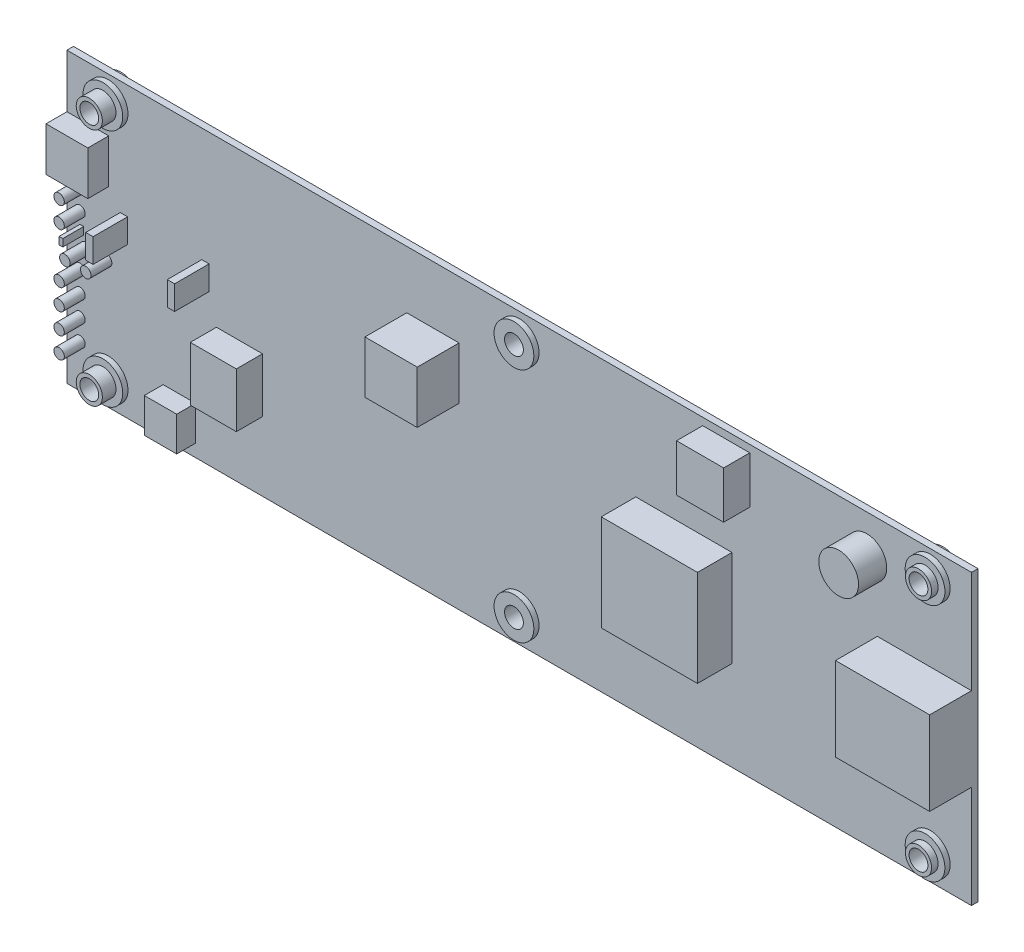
from build123d import *

# Parameters (mm, degrees)
SKETCH1_W           = 219.71
SKETCH1_H           = 70.104
PC_BOARD_DEPTH      = 1.5875
SKETCH2_R           = 2.286
THRU_HOLES_DEPTH    = 231.628651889
SKETCH4_W           = 12.7
SKETCH4_H           = 12.7
TRANSFORMER_DEPTH   = 10.16
SKETCH5_W           = 22.86
SKETCH5_H           = 20.32
CONNECTOR_DEPTH     = 10.16
SKETCH6_W           = 23.368
SKETCH6_H           = 23.368
CPU_DEPTH           = 8.382
SKETCH7_W           = 11.43
SKETCH7_H           = 11.43
INDUCTOR_DEPTH      = 6.35
SKETCH8_W           = 7.874
SKETCH8_H           = 8.382
VISHAY_DEPTH        = 4.572
SKETCH9_W           = 1.778
SKETCH9_H           = 5.842
CAPS_DEPTH          = 8.382
SKETCH10_W          = 11.176
SKETCH10_H          = 13.208
CRYSTAL_DEPTH       = 6.35
SKETCH11_R          = 4.826
EXTRUDE9_DEPTH      = 6.858
SKETCH13_R          = 1.27
SKETCH13_W          = 0.911656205
SKETCH13_H          = 1.789200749
SOLDER_PINS_DEPTH   = 5.08
SKETCH14_W          = 10.16
SKETCH14_H          = 10.668
VISHAY2_DEPTH       = 5.08
GROMMETS_START      = 1.27
SKETCH15_R          = 4.826
SKETCH15_R_2        = 2.286
GROMMETS_DEPTH      = 1.27
REAR_SPACERS_START  = 3.302
SKETCH16_R          = 3.175
SKETCH16_R_2        = 2.286
REAR_SPACERS_DEPTH  = 3.302
FRONT_SPACERS_START = 1.5875
SKETCH18_R          = 3.175
SKETCH18_R_2        = 2.286
FRONT_SPACERS_DEPTH = 1.5875
SKETCH19_R          = 4.826
SKETCH19_R_2        = 2.286
BACK_GROMMETS_DEPTH = 1.524


with BuildPart() as part:
    # Sketch1 → pc_board (new body)
    with BuildSketch(Plane.XY):
        with Locations((109.855, 35.052)):
            Rectangle(SKETCH1_W, SKETCH1_H)
    extrude(amount=PC_BOARD_DEPTH)

    # Sketch2 → thru_holes (cut, through all)
    with BuildSketch(Plane.XY.offset(1.5875)):
        with Locations((209.7024, 64.1096)):
            Circle(SKETCH2_R)
        with Locations(Location((10.0076, 64.1096, 0), (0, 0, 180))):
            Circle(SKETCH2_R)
        with Locations((109.855, 63.754)):
            Circle(SKETCH2_R)
        with Locations(Location((209.7024, 5.9944, 0), (0, 0, 180))):
            Circle(SKETCH2_R)
        with Locations(Location((109.855, 6.35, 0), (0, 0, 180))):
            Circle(SKETCH2_R)
        with Locations((10.0076, 5.9944)):
            Circle(SKETCH2_R)
    extrude(amount=-THRU_HOLES_DEPTH, mode=Mode.SUBTRACT)

    # Sketch4 → transformer (add)
    with BuildSketch(Plane.XY.offset(1.5875)):
        with Locations((88.9, 49.784)):
            Rectangle(SKETCH4_W, SKETCH4_H)
    extrude(amount=TRANSFORMER_DEPTH)

    # Sketch5 → connector (add)
    with BuildSketch(Plane.XY.offset(1.5875)):
        with Locations((208.28, 35.052)):
            Rectangle(SKETCH5_W, SKETCH5_H)
    extrude(amount=CONNECTOR_DEPTH)

    # Sketch6 → cpu (add)
    with BuildSketch(Plane.XY.offset(1.5875)):
        with Locations((149.86, 33.528)):
            Rectangle(SKETCH6_W, SKETCH6_H)
    extrude(amount=CPU_DEPTH)

    # Sketch7 → inductor (add)
    with BuildSketch(Plane.XY.offset(1.5875)):
        with Locations((160.147, 62.611)):
            Rectangle(SKETCH7_W, SKETCH7_H)
    extrude(amount=INDUCTOR_DEPTH)

    # Sketch8 → Vishay (add)
    with BuildSketch(Plane.XY.offset(1.5875)):
        with Locations((27.305, 7.239)):
            Rectangle(SKETCH8_W, SKETCH8_H)
    extrude(amount=VISHAY_DEPTH)

    # Sketch9 → caps (add)
    with BuildSketch(Plane.XY.offset(1.5875)):
        with Locations((13.843, 39.497)):
            Rectangle(SKETCH9_W, SKETCH9_H)
        with Locations((33.655, 39.497)):
            Rectangle(SKETCH9_W, SKETCH9_H)
    extrude(amount=CAPS_DEPTH)

    # Sketch10 → crystal (add)
    with BuildSketch(Plane.XY.offset(1.5875)):
        with Locations((41.91, 23.368)):
            Rectangle(SKETCH10_W, SKETCH10_H)
    extrude(amount=CRYSTAL_DEPTH)

    # Sketch11 → Extrude9 (add)
    with BuildSketch(Plane.XY.offset(1.5875)):
        with Locations(Location((194.31, 60.706, 0), (0, 0, 180))):
            Circle(SKETCH11_R)
    extrude(amount=EXTRUDE9_DEPTH)

    # Sketch13 → solder_pins (add)
    with BuildSketch(Plane.XY.offset(1.5875)):
        with Locations(Location((3.175, 42.926, 0), (0, 0, 180))):
            Circle(SKETCH13_R)
        with Locations(Location((3.175, 37.846, 0), (0, 0, 180))):
            Circle(SKETCH13_R)
        with Locations(Location((3.175, 25.654, 0), (0, 0, 180))):
            Circle(SKETCH13_R)
        with Locations(Location((3.175, 20.574, 0), (0, 0, 180))):
            Circle(SKETCH13_R)
        with Locations(Location((3.175, 15.494, 0), (0, 0, 180))):
            Circle(SKETCH13_R)
        with Locations(Location((3.175, 10.414, 0), (0, 0, 180))):
            Circle(SKETCH13_R)
        with Locations(Location((4.572, 30.734, 0), (0, 0, 180))):
            Circle(SKETCH13_R)
        with Locations(Location((9.652, 30.734, 0), (0, 0, 180))):
            Circle(SKETCH13_R)
        with Locations((3.630828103, 34.157399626)):
            Rectangle(SKETCH13_W, SKETCH13_H)
    extrude(amount=SOLDER_PINS_DEPTH)

    # Sketch14 → vishay2 (add)
    with BuildSketch(Plane.XY.offset(1.5875)):
        with Locations((5.08, 51.816)):
            Rectangle(SKETCH14_W, SKETCH14_H)
    extrude(amount=VISHAY2_DEPTH)

    # Sketch15 → grommets (add)
    # profile 1 of 6: a face of its own
    with BuildSketch(Plane.XY.offset(1.5875).offset(GROMMETS_START)):
        with Locations(Location((209.7024, 64.1096, 0), (0, 0, 180))):
            Circle(SKETCH15_R)
        with Locations((209.7024, 64.1096)):
            Circle(SKETCH15_R_2, mode=Mode.SUBTRACT)
    # profile 2 of 6: a face of its own
    with BuildSketch(Plane.XY.offset(1.5875).offset(GROMMETS_START)):
        with Locations(Location((10.0076, 64.1096, 0), (0, 0, 180))):
            Circle(SKETCH15_R)
        with Locations(Location((10.0076, 64.1096, 0), (0, 0, 180))):
            Circle(SKETCH15_R_2, mode=Mode.SUBTRACT)
    # profile 3 of 6: a face of its own
    with BuildSketch(Plane.XY.offset(1.5875).offset(GROMMETS_START)):
        with Locations(Location((109.855, 63.754, 0), (0, 0, 180))):
            Circle(SKETCH15_R)
        with Locations((109.855, 63.754)):
            Circle(SKETCH15_R_2, mode=Mode.SUBTRACT)
    # profile 4 of 6: a face of its own
    with BuildSketch(Plane.XY.offset(1.5875).offset(GROMMETS_START)):
        with Locations(Location((109.855, 6.35, 0), (0, 0, 180))):
            Circle(SKETCH15_R)
        with Locations(Location((109.855, 6.35, 0), (0, 0, 180))):
            Circle(SKETCH15_R_2, mode=Mode.SUBTRACT)
    # profile 5 of 6: a face of its own
    with BuildSketch(Plane.XY.offset(1.5875).offset(GROMMETS_START)):
        with Locations(Location((10.0076, 5.9944, 0), (0, 0, 180))):
            Circle(SKETCH15_R)
        with Locations((10.0076, 5.9944)):
            Circle(SKETCH15_R_2, mode=Mode.SUBTRACT)
    # profile 6 of 6: a face of its own
    with BuildSketch(Plane.XY.offset(1.5875).offset(GROMMETS_START)):
        with Locations(Location((209.7024, 5.9944, 0), (0, 0, 180))):
            Circle(SKETCH15_R)
        with Locations(Location((209.7024, 5.9944, 0), (0, 0, 180))):
            Circle(SKETCH15_R_2, mode=Mode.SUBTRACT)
    extrude(amount=-GROMMETS_DEPTH)

    # Sketch16 → rear_spacers (add)
    # profile 1 of 2: a face of its own
    with BuildSketch(Plane.XY.offset(2.8575).offset(REAR_SPACERS_START)):
        with Locations(Location((10.0076, 64.1096, 0), (0, 0, 180))):
            Circle(SKETCH16_R)
        with Locations((10.0076, 64.1096)):
            Circle(SKETCH16_R_2, mode=Mode.SUBTRACT)
    # profile 2 of 2: a face of its own
    with BuildSketch(Plane.XY.offset(2.8575).offset(REAR_SPACERS_START)):
        with Locations(Location((10.0076, 5.9944, 0), (0, 0, 180))):
            Circle(SKETCH16_R)
        with Locations((10.0076, 5.9944)):
            Circle(SKETCH16_R_2, mode=Mode.SUBTRACT)
    extrude(amount=-REAR_SPACERS_DEPTH)

    # Sketch18 → front_spacers (add)
    # profile 1 of 2: a face of its own
    with BuildSketch(Plane.XY.offset(2.8575).offset(FRONT_SPACERS_START)):
        with Locations(Location((209.7024, 5.9944, 0), (0, 0, 180))):
            Circle(SKETCH18_R)
        with Locations((209.7024, 5.9944)):
            Circle(SKETCH18_R_2, mode=Mode.SUBTRACT)
    # profile 2 of 2: a face of its own
    with BuildSketch(Plane.XY.offset(2.8575).offset(FRONT_SPACERS_START)):
        with Locations((209.7024, 64.1096)):
            Circle(SKETCH18_R)
        with Locations((209.7024, 64.1096)):
            Circle(SKETCH18_R_2, mode=Mode.SUBTRACT)
    extrude(amount=-FRONT_SPACERS_DEPTH)

    # Sketch19 → back_grommets (add)
    # profile 1 of 6: a face of its own
    with BuildSketch(Plane(origin=(0, 0, 0), x_dir=(-1, 0, 0), z_dir=(0, 0, -1))):
        with Locations((-10.0076, 64.1096)):
            Circle(SKETCH19_R)
        with Locations(Location((-10.0076, 64.1096, 0), (0, 0, 180))):
            Circle(SKETCH19_R_2, mode=Mode.SUBTRACT)
    # profile 2 of 6: a face of its own
    with BuildSketch(Plane(origin=(0, 0, 0), x_dir=(-1, 0, 0), z_dir=(0, 0, -1))):
        with Locations((-10.0076, 5.9944)):
            Circle(SKETCH19_R)
        with Locations(Location((-10.0076, 5.9944, 0), (0, 0, 180))):
            Circle(SKETCH19_R_2, mode=Mode.SUBTRACT)
    # profile 3 of 6: a face of its own
    with BuildSketch(Plane(origin=(0, 0, 0), x_dir=(-1, 0, 0), z_dir=(0, 0, -1))):
        with Locations((-109.855, 6.35)):
            Circle(SKETCH19_R)
        with Locations((-109.855, 6.35)):
            Circle(SKETCH19_R_2, mode=Mode.SUBTRACT)
    # profile 4 of 6: a face of its own
    with BuildSketch(Plane(origin=(0, 0, 0), x_dir=(-1, 0, 0), z_dir=(0, 0, -1))):
        with Locations((-109.855, 63.754)):
            Circle(SKETCH19_R)
        with Locations(Location((-109.855, 63.754, 0), (0, 0, 180))):
            Circle(SKETCH19_R_2, mode=Mode.SUBTRACT)
    # profile 5 of 6: a face of its own
    with BuildSketch(Plane(origin=(0, 0, 0), x_dir=(-1, 0, 0), z_dir=(0, 0, -1))):
        with Locations((-209.7024, 5.9944)):
            Circle(SKETCH19_R)
        with Locations(Location((-209.7024, 5.9944, 0), (0, 0, 180))):
            Circle(SKETCH19_R_2, mode=Mode.SUBTRACT)
    # profile 6 of 6: a face of its own
    with BuildSketch(Plane(origin=(0, 0, 0), x_dir=(-1, 0, 0), z_dir=(0, 0, -1))):
        with Locations((-209.7024, 64.1096)):
            Circle(SKETCH19_R)
        with Locations(Location((-209.7024, 64.1096, 0), (0, 0, 180))):
            Circle(SKETCH19_R_2, mode=Mode.SUBTRACT)
    extrude(amount=BACK_GROMMETS_DEPTH)


solid = part.part
